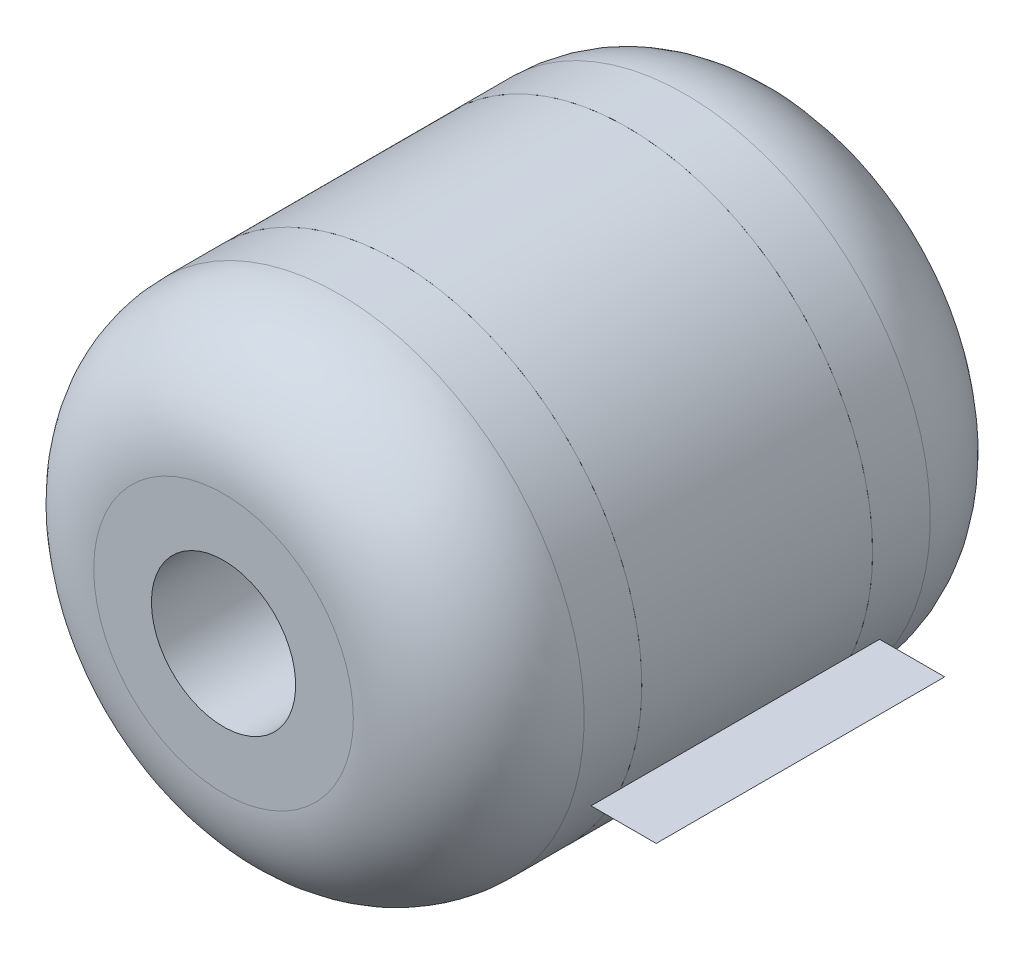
ISO-10303-21;
HEADER;
FILE_DESCRIPTION(('STEP AP214'),'2;1');
FILE_NAME('part.step','',(''),(''),'','','');
FILE_SCHEMA(('AUTOMOTIVE_DESIGN { 1 0 10303 214 1 1 1 1 }'));
ENDSEC;
DATA;
#1=APPLICATION_CONTEXT('core data for automotive mechanical design processes');
#2=APPLICATION_PROTOCOL_DEFINITION('international standard','automotive_design',2000,#1);
#3=PRODUCT_CONTEXT('',#1,'mechanical');
#4=PRODUCT('Part','Part','',(#3));
#5=PRODUCT_RELATED_PRODUCT_CATEGORY('part','',(#4));
#6=PRODUCT_DEFINITION_FORMATION('','',#4);
#7=PRODUCT_DEFINITION_CONTEXT('part definition',#1,'design');
#8=PRODUCT_DEFINITION('design','',#6,#7);
#9=PRODUCT_DEFINITION_SHAPE('','',#8);
#10=(LENGTH_UNIT() NAMED_UNIT(*) SI_UNIT(.MILLI.,.METRE.));
#11=(NAMED_UNIT(*) PLANE_ANGLE_UNIT() SI_UNIT($,.RADIAN.));
#12=(NAMED_UNIT(*) SI_UNIT($,.STERADIAN.) SOLID_ANGLE_UNIT());
#13=UNCERTAINTY_MEASURE_WITH_UNIT(LENGTH_MEASURE(1.E-05),#10,'distance_accuracy_value','');
#14=(GEOMETRIC_REPRESENTATION_CONTEXT(3) GLOBAL_UNCERTAINTY_ASSIGNED_CONTEXT((#13)) GLOBAL_UNIT_ASSIGNED_CONTEXT((#10,
#11,#12)) REPRESENTATION_CONTEXT('',''));
#15=CARTESIAN_POINT('',(0.,0.,0.));
#16=DIRECTION('',(0.,0.,1.));
#17=DIRECTION('',(1.,0.,0.));
#18=AXIS2_PLACEMENT_3D('',#15,#16,#17);
#19=CARTESIAN_POINT('',(0.,-0.35,-0.5));
#20=DIRECTION('',(0.,1.,0.));
#21=DIRECTION('',(-1.,0.,0.));
#22=AXIS2_PLACEMENT_3D('',#19,#20,#21);
#23=PLANE('',#22);
#24=DIRECTION('',(-1.,0.,0.));
#25=VECTOR('',#24,1.);
#26=CARTESIAN_POINT('',(0.,-0.35,0.5));
#27=LINE('',#26,#25);
#28=CARTESIAN_POINT('',(1.,-0.35,0.5));
#29=VERTEX_POINT('',#28);
#30=CARTESIAN_POINT('',(-1.,-0.35,0.5));
#31=VERTEX_POINT('',#30);
#32=EDGE_CURVE('E71',#29,#31,#27,.T.);
#33=ORIENTED_EDGE('',*,*,#32,.F.);
#34=DIRECTION('',(0.,0.,1.));
#35=VECTOR('',#34,1.);
#36=CARTESIAN_POINT('',(1.,-0.35,-0.5));
#37=LINE('',#36,#35);
#38=CARTESIAN_POINT('',(1.,-0.35,-0.5));
#39=VERTEX_POINT('',#38);
#40=EDGE_CURVE('E53',#39,#29,#37,.T.);
#41=ORIENTED_EDGE('',*,*,#40,.F.);
#42=DIRECTION('',(-1.,0.,0.));
#43=VECTOR('',#42,1.);
#44=CARTESIAN_POINT('',(0.,-0.35,-0.5));
#45=LINE('',#44,#43);
#46=CARTESIAN_POINT('',(-1.,-0.35,-0.5));
#47=VERTEX_POINT('',#46);
#48=EDGE_CURVE('E12',#39,#47,#45,.T.);
#49=ORIENTED_EDGE('',*,*,#48,.T.);
#50=DIRECTION('',(0.,0.,1.));
#51=VECTOR('',#50,1.);
#52=CARTESIAN_POINT('',(-1.,-0.35,-0.5));
#53=LINE('',#52,#51);
#54=EDGE_CURVE('E73',#47,#31,#53,.T.);
#55=ORIENTED_EDGE('',*,*,#54,.T.);
#56=EDGE_LOOP('',(#33,#41,#49,#55));
#57=FACE_BOUND('',#56,.T.);
#58=ADVANCED_FACE('F52',(#57),#23,.T.);
#59=OPEN_SHELL('',(#58));
#60=SHELL_BASED_SURFACE_MODEL('B2',(#59));
#61=CARTESIAN_POINT('',(0.,0.,1.));
#62=DIRECTION('',(0.,0.,1.));
#63=DIRECTION('',(-1.,0.,0.));
#64=AXIS2_PLACEMENT_3D('',#61,#62,#63);
#65=PLANE('',#64);
#66=CARTESIAN_POINT('',(0.,0.,1.));
#67=DIRECTION('',(0.,0.,-1.));
#68=DIRECTION('',(-1.,0.,0.));
#69=AXIS2_PLACEMENT_3D('',#66,#67,#68);
#70=CIRCLE('',#69,0.45);
#71=CARTESIAN_POINT('',(-0.45,0.,1.));
#72=VERTEX_POINT('',#71);
#73=EDGE_CURVE('E118',#72,#72,#70,.T.);
#74=ORIENTED_EDGE('',*,*,#73,.F.);
#75=EDGE_LOOP('',(#74));
#76=FACE_BOUND('',#75,.T.);
#77=CARTESIAN_POINT('',(0.,0.,1.));
#78=DIRECTION('',(0.,0.,-1.));
#79=DIRECTION('',(-1.,0.,0.));
#80=AXIS2_PLACEMENT_3D('',#77,#78,#79);
#81=CIRCLE('',#80,0.25);
#82=CARTESIAN_POINT('',(-0.25,0.,1.));
#83=VERTEX_POINT('',#82);
#84=EDGE_CURVE('E126',#83,#83,#81,.T.);
#85=ORIENTED_EDGE('',*,*,#84,.T.);
#86=EDGE_LOOP('',(#85));
#87=FACE_BOUND('',#86,.T.);
#88=ADVANCED_FACE('F111',(#76,#87),#65,.T.);
#89=CARTESIAN_POINT('',(0.,0.,0.4));
#90=DIRECTION('',(0.,0.,1.));
#91=DIRECTION('',(-1.,0.,0.));
#92=AXIS2_PLACEMENT_3D('',#89,#90,#91);
#93=PLANE('',#92);
#94=CARTESIAN_POINT('',(0.,0.,0.4));
#95=DIRECTION('',(0.,0.,-1.));
#96=DIRECTION('',(-1.,0.,0.));
#97=AXIS2_PLACEMENT_3D('',#94,#95,#96);
#98=CIRCLE('',#97,0.85);
#99=CARTESIAN_POINT('',(-0.85,0.,0.4));
#100=VERTEX_POINT('',#99);
#101=EDGE_CURVE('E122',#100,#100,#98,.T.);
#102=ORIENTED_EDGE('',*,*,#101,.T.);
#103=EDGE_LOOP('',(#102));
#104=FACE_BOUND('',#103,.T.);
#105=CARTESIAN_POINT('',(0.,0.,0.4));
#106=DIRECTION('',(0.,0.,-1.));
#107=DIRECTION('',(-1.,0.,0.));
#108=AXIS2_PLACEMENT_3D('',#105,#106,#107);
#109=CIRCLE('',#108,0.25);
#110=CARTESIAN_POINT('',(-0.25,0.,0.4));
#111=VERTEX_POINT('',#110);
#112=EDGE_CURVE('E129',#111,#111,#109,.T.);
#113=ORIENTED_EDGE('',*,*,#112,.F.);
#114=EDGE_LOOP('',(#113));
#115=FACE_BOUND('',#114,.T.);
#116=ADVANCED_FACE('F143',(#104,#115),#93,.F.);
#117=CARTESIAN_POINT('',(0.,0.,1.));
#118=DIRECTION('',(0.,0.,-1.));
#119=DIRECTION('',(1.,0.,0.));
#120=AXIS2_PLACEMENT_3D('',#117,#118,#119);
#121=CYLINDRICAL_SURFACE('',#120,0.85);
#122=CARTESIAN_POINT('',(0.,0.,0.6));
#123=DIRECTION('',(0.,0.,-1.));
#124=DIRECTION('',(-1.,0.,0.));
#125=AXIS2_PLACEMENT_3D('',#122,#123,#124);
#126=CIRCLE('',#125,0.85);
#127=CARTESIAN_POINT('',(-0.85,0.,0.6));
#128=VERTEX_POINT('',#127);
#129=EDGE_CURVE('E51',#128,#128,#126,.F.);
#130=ORIENTED_EDGE('',*,*,#129,.F.);
#131=EDGE_LOOP('',(#130));
#132=FACE_BOUND('',#131,.T.);
#133=ORIENTED_EDGE('',*,*,#101,.F.);
#134=EDGE_LOOP('',(#133));
#135=FACE_BOUND('',#134,.T.);
#136=ADVANCED_FACE('F139',(#132,#135),#121,.T.);
#137=CARTESIAN_POINT('',(0.,0.,1.));
#138=DIRECTION('',(0.,0.,-1.));
#139=DIRECTION('',(1.,0.,0.));
#140=AXIS2_PLACEMENT_3D('',#137,#138,#139);
#141=CYLINDRICAL_SURFACE('',#140,0.25);
#142=ORIENTED_EDGE('',*,*,#84,.F.);
#143=EDGE_LOOP('',(#142));
#144=FACE_BOUND('',#143,.T.);
#145=ORIENTED_EDGE('',*,*,#112,.T.);
#146=EDGE_LOOP('',(#145));
#147=FACE_BOUND('',#146,.T.);
#148=ADVANCED_FACE('F136',(#144,#147),#141,.F.);
#149=CARTESIAN_POINT('',(0.,0.,0.6));
#150=DIRECTION('',(0.,0.,1.));
#151=DIRECTION('',(-1.,0.,0.));
#152=AXIS2_PLACEMENT_3D('',#149,#150,#151);
#153=TOROIDAL_SURFACE('',#152,0.45,0.4);
#154=ORIENTED_EDGE('',*,*,#129,.T.);
#155=EDGE_LOOP('',(#154));
#156=FACE_BOUND('',#155,.T.);
#157=ORIENTED_EDGE('',*,*,#73,.T.);
#158=EDGE_LOOP('',(#157));
#159=FACE_BOUND('',#158,.T.);
#160=ADVANCED_FACE('F113',(#156,#159),#153,.T.);
#161=CLOSED_SHELL('',(#88,#116,#136,#148,#160));
#162=MANIFOLD_SOLID_BREP('B6',#161);
#163=CARTESIAN_POINT('',(0.,0.,-1.));
#164=DIRECTION('',(0.,0.,-1.));
#165=DIRECTION('',(-1.,0.,0.));
#166=AXIS2_PLACEMENT_3D('',#163,#164,#165);
#167=PLANE('',#166);
#168=CARTESIAN_POINT('',(0.,0.,-1.));
#169=DIRECTION('',(0.,0.,-1.));
#170=DIRECTION('',(-1.,0.,0.));
#171=AXIS2_PLACEMENT_3D('',#168,#169,#170);
#172=CIRCLE('',#171,0.45);
#173=CARTESIAN_POINT('',(-0.45,0.,-1.));
#174=VERTEX_POINT('',#173);
#175=EDGE_CURVE('E202',#174,#174,#172,.T.);
#176=ORIENTED_EDGE('',*,*,#175,.T.);
#177=EDGE_LOOP('',(#176));
#178=FACE_BOUND('',#177,.T.);
#179=CARTESIAN_POINT('',(0.,0.,-1.));
#180=DIRECTION('',(0.,0.,-1.));
#181=DIRECTION('',(-1.,0.,0.));
#182=AXIS2_PLACEMENT_3D('',#179,#180,#181);
#183=CIRCLE('',#182,0.25);
#184=CARTESIAN_POINT('',(-0.25,0.,-1.));
#185=VERTEX_POINT('',#184);
#186=EDGE_CURVE('E210',#185,#185,#183,.T.);
#187=ORIENTED_EDGE('',*,*,#186,.F.);
#188=EDGE_LOOP('',(#187));
#189=FACE_BOUND('',#188,.T.);
#190=ADVANCED_FACE('F195',(#178,#189),#167,.T.);
#191=CARTESIAN_POINT('',(0.,0.,-0.4));
#192=DIRECTION('',(0.,0.,-1.));
#193=DIRECTION('',(-1.,0.,0.));
#194=AXIS2_PLACEMENT_3D('',#191,#192,#193);
#195=PLANE('',#194);
#196=CARTESIAN_POINT('',(0.,0.,-0.4));
#197=DIRECTION('',(0.,0.,-1.));
#198=DIRECTION('',(-1.,0.,0.));
#199=AXIS2_PLACEMENT_3D('',#196,#197,#198);
#200=CIRCLE('',#199,0.85);
#201=CARTESIAN_POINT('',(-0.85,0.,-0.4));
#202=VERTEX_POINT('',#201);
#203=EDGE_CURVE('E206',#202,#202,#200,.T.);
#204=ORIENTED_EDGE('',*,*,#203,.F.);
#205=EDGE_LOOP('',(#204));
#206=FACE_BOUND('',#205,.T.);
#207=CARTESIAN_POINT('',(0.,0.,-0.4));
#208=DIRECTION('',(0.,0.,-1.));
#209=DIRECTION('',(-1.,0.,0.));
#210=AXIS2_PLACEMENT_3D('',#207,#208,#209);
#211=CIRCLE('',#210,0.25);
#212=CARTESIAN_POINT('',(-0.25,0.,-0.4));
#213=VERTEX_POINT('',#212);
#214=EDGE_CURVE('E213',#213,#213,#211,.T.);
#215=ORIENTED_EDGE('',*,*,#214,.T.);
#216=EDGE_LOOP('',(#215));
#217=FACE_BOUND('',#216,.T.);
#218=ADVANCED_FACE('F223',(#206,#217),#195,.F.);
#219=CARTESIAN_POINT('',(0.,0.,-1.));
#220=DIRECTION('',(0.,0.,1.));
#221=DIRECTION('',(1.,0.,0.));
#222=AXIS2_PLACEMENT_3D('',#219,#220,#221);
#223=CYLINDRICAL_SURFACE('',#222,0.85);
#224=CARTESIAN_POINT('',(0.,0.,-0.6));
#225=DIRECTION('',(0.,0.,-1.));
#226=DIRECTION('',(-1.,0.,0.));
#227=AXIS2_PLACEMENT_3D('',#224,#225,#226);
#228=CIRCLE('',#227,0.85);
#229=CARTESIAN_POINT('',(-0.85,0.,-0.6));
#230=VERTEX_POINT('',#229);
#231=EDGE_CURVE('E110',#230,#230,#228,.F.);
#232=ORIENTED_EDGE('',*,*,#231,.T.);
#233=EDGE_LOOP('',(#232));
#234=FACE_BOUND('',#233,.T.);
#235=ORIENTED_EDGE('',*,*,#203,.T.);
#236=EDGE_LOOP('',(#235));
#237=FACE_BOUND('',#236,.T.);
#238=ADVANCED_FACE('F230',(#234,#237),#223,.T.);
#239=CARTESIAN_POINT('',(0.,0.,-1.));
#240=DIRECTION('',(0.,0.,1.));
#241=DIRECTION('',(1.,0.,0.));
#242=AXIS2_PLACEMENT_3D('',#239,#240,#241);
#243=CYLINDRICAL_SURFACE('',#242,0.25);
#244=ORIENTED_EDGE('',*,*,#186,.T.);
#245=EDGE_LOOP('',(#244));
#246=FACE_BOUND('',#245,.T.);
#247=ORIENTED_EDGE('',*,*,#214,.F.);
#248=EDGE_LOOP('',(#247));
#249=FACE_BOUND('',#248,.T.);
#250=ADVANCED_FACE('F219',(#246,#249),#243,.F.);
#251=CARTESIAN_POINT('',(0.,0.,-0.6));
#252=DIRECTION('',(0.,0.,-1.));
#253=DIRECTION('',(-1.,0.,0.));
#254=AXIS2_PLACEMENT_3D('',#251,#252,#253);
#255=TOROIDAL_SURFACE('',#254,0.45,0.4);
#256=ORIENTED_EDGE('',*,*,#231,.F.);
#257=EDGE_LOOP('',(#256));
#258=FACE_BOUND('',#257,.T.);
#259=ORIENTED_EDGE('',*,*,#175,.F.);
#260=EDGE_LOOP('',(#259));
#261=FACE_BOUND('',#260,.T.);
#262=ADVANCED_FACE('F197',(#258,#261),#255,.T.);
#263=CLOSED_SHELL('',(#190,#218,#238,#250,#262));
#264=MANIFOLD_SOLID_BREP('B46',#263);
#265=CARTESIAN_POINT('',(0.,0.,0.4));
#266=DIRECTION('',(0.,0.,1.));
#267=DIRECTION('',(1.,0.,0.));
#268=AXIS2_PLACEMENT_3D('',#265,#266,#267);
#269=PLANE('',#268);
#270=CARTESIAN_POINT('',(0.,0.,0.4));
#271=DIRECTION('',(0.,0.,1.));
#272=DIRECTION('',(1.,0.,0.));
#273=AXIS2_PLACEMENT_3D('',#270,#271,#272);
#274=CIRCLE('',#273,0.85);
#275=CARTESIAN_POINT('',(0.85,0.,0.4));
#276=VERTEX_POINT('',#275);
#277=EDGE_CURVE('E194',#276,#276,#274,.T.);
#278=ORIENTED_EDGE('',*,*,#277,.T.);
#279=EDGE_LOOP('',(#278));
#280=FACE_BOUND('',#279,.T.);
#281=CARTESIAN_POINT('',(0.,0.,0.4));
#282=DIRECTION('',(0.,0.,1.));
#283=DIRECTION('',(1.,0.,0.));
#284=AXIS2_PLACEMENT_3D('',#281,#282,#283);
#285=CIRCLE('',#284,0.25);
#286=CARTESIAN_POINT('',(0.25,0.,0.4));
#287=VERTEX_POINT('',#286);
#288=EDGE_CURVE('E283',#287,#287,#285,.T.);
#289=ORIENTED_EDGE('',*,*,#288,.F.);
#290=EDGE_LOOP('',(#289));
#291=FACE_BOUND('',#290,.T.);
#292=ADVANCED_FACE('F272',(#280,#291),#269,.T.);
#293=CARTESIAN_POINT('',(0.,0.,-0.4));
#294=DIRECTION('',(0.,0.,1.));
#295=DIRECTION('',(1.,0.,0.));
#296=AXIS2_PLACEMENT_3D('',#293,#294,#295);
#297=PLANE('',#296);
#298=CARTESIAN_POINT('',(0.,0.,-0.4));
#299=DIRECTION('',(0.,0.,1.));
#300=DIRECTION('',(1.,0.,0.));
#301=AXIS2_PLACEMENT_3D('',#298,#299,#300);
#302=CIRCLE('',#301,0.85);
#303=CARTESIAN_POINT('',(0.85,0.,-0.4));
#304=VERTEX_POINT('',#303);
#305=EDGE_CURVE('E276',#304,#304,#302,.T.);
#306=ORIENTED_EDGE('',*,*,#305,.F.);
#307=EDGE_LOOP('',(#306));
#308=FACE_BOUND('',#307,.T.);
#309=CARTESIAN_POINT('',(0.,0.,-0.4));
#310=DIRECTION('',(0.,0.,1.));
#311=DIRECTION('',(1.,0.,0.));
#312=AXIS2_PLACEMENT_3D('',#309,#310,#311);
#313=CIRCLE('',#312,0.25);
#314=CARTESIAN_POINT('',(0.25,0.,-0.4));
#315=VERTEX_POINT('',#314);
#316=EDGE_CURVE('E285',#315,#315,#313,.T.);
#317=ORIENTED_EDGE('',*,*,#316,.T.);
#318=EDGE_LOOP('',(#317));
#319=FACE_BOUND('',#318,.T.);
#320=ADVANCED_FACE('F295',(#308,#319),#297,.F.);
#321=CARTESIAN_POINT('',(0.,0.,0.4));
#322=DIRECTION('',(0.,0.,-1.));
#323=DIRECTION('',(-1.,0.,0.));
#324=AXIS2_PLACEMENT_3D('',#321,#322,#323);
#325=CYLINDRICAL_SURFACE('',#324,0.85);
#326=ORIENTED_EDGE('',*,*,#277,.F.);
#327=EDGE_LOOP('',(#326));
#328=FACE_BOUND('',#327,.T.);
#329=ORIENTED_EDGE('',*,*,#305,.T.);
#330=EDGE_LOOP('',(#329));
#331=FACE_BOUND('',#330,.T.);
#332=ADVANCED_FACE('F274',(#328,#331),#325,.T.);
#333=CARTESIAN_POINT('',(0.,0.,0.4));
#334=DIRECTION('',(0.,0.,-1.));
#335=DIRECTION('',(-1.,0.,0.));
#336=AXIS2_PLACEMENT_3D('',#333,#334,#335);
#337=CYLINDRICAL_SURFACE('',#336,0.25);
#338=ORIENTED_EDGE('',*,*,#288,.T.);
#339=EDGE_LOOP('',(#338));
#340=FACE_BOUND('',#339,.T.);
#341=ORIENTED_EDGE('',*,*,#316,.F.);
#342=EDGE_LOOP('',(#341));
#343=FACE_BOUND('',#342,.T.);
#344=ADVANCED_FACE('F291',(#340,#343),#337,.F.);
#345=CLOSED_SHELL('',(#292,#320,#332,#344));
#346=MANIFOLD_SOLID_BREP('B105',#345);
#347=ADVANCED_BREP_SHAPE_REPRESENTATION('',(#18,#162,#264,#346),#14);
#348=MANIFOLD_SURFACE_SHAPE_REPRESENTATION('',(#18,#60),#14);
#349=SHAPE_REPRESENTATION('',(#18),#14);
#350=SHAPE_DEFINITION_REPRESENTATION(#9,#349);
#351=SHAPE_REPRESENTATION_RELATIONSHIP('','',#349,#347);
#352=SHAPE_REPRESENTATION_RELATIONSHIP('','',#349,#348);
ENDSEC;
END-ISO-10303-21;
